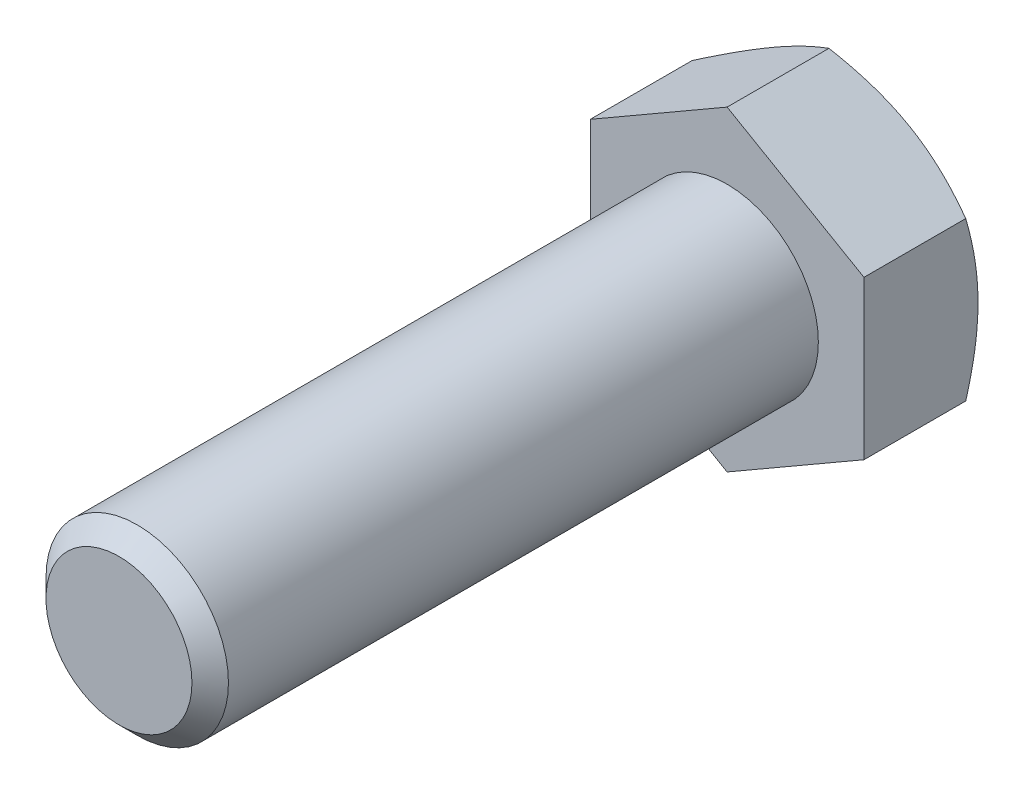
from build123d import *

# Parameters (mm, degrees)
ESQUISSE1_W        = 6
ESQUISSE1_H        = 40
CHANFREIN1_SIZE    = 1.2
BOSS_EXTRU_1_DEPTH = 7.5


with BuildPart() as part:
    # Esquisse1 → Base-R_volution (revolve)
    with BuildSketch(Plane(origin=(0, 0, 0), x_dir=(1, 0, 0), z_dir=(0, 1, 0))):
        with Locations((3, -20)):
            Rectangle(ESQUISSE1_W, ESQUISSE1_H)
    revolve(axis=Axis((0, 0, 0), (0, 0, 1)))

    # Chanfrein1
    chanfrein1_edges = [part.edges().sort_by_distance(p)[0] for p in [
        (-6, 0, 40),
    ]]
    chamfer(chanfrein1_edges, length=CHANFREIN1_SIZE)

    # Esquisse6 → Boss.-Extru.1 (add)
    with BuildSketch(Plane.XY):
        Polygon((9, -5.196152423), (9, 5.196152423), (0, 10.392304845), (-9, 5.196152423), (-9, -5.196152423), (0, -10.392304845), align=None)
    extrude(amount=-BOSS_EXTRU_1_DEPTH)

    # Esquisse7 → Enl_vement de mati_re-R_volution1 (revolve, cut)
    with BuildSketch(Plane(origin=(0, 0, 0), x_dir=(1, 0, 0), z_dir=(0, 1, 0))):
        Polygon((-9, 7.5), (-21.990381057, 7.5), (-21.990381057, 0), align=None)
    revolve(axis=Axis((0, 0, -6.239446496), (0, 0, 1)), mode=Mode.SUBTRACT)


solid = part.part
